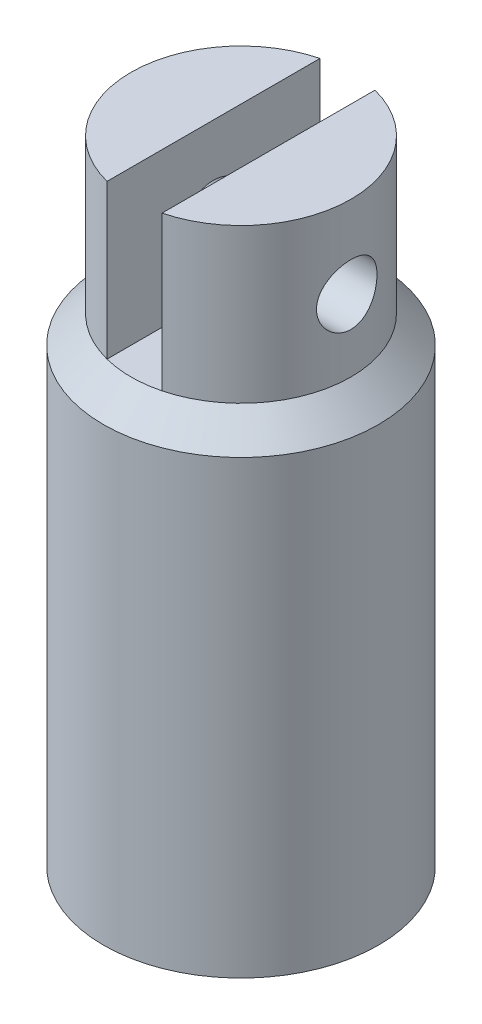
ISO-10303-21;
HEADER;
FILE_DESCRIPTION(('STEP AP214'),'2;1');
FILE_NAME('part.step','',(''),(''),'','','');
FILE_SCHEMA(('AUTOMOTIVE_DESIGN { 1 0 10303 214 1 1 1 1 }'));
ENDSEC;
DATA;
#1=APPLICATION_CONTEXT('core data for automotive mechanical design processes');
#2=APPLICATION_PROTOCOL_DEFINITION('international standard','automotive_design',2000,#1);
#3=PRODUCT_CONTEXT('',#1,'mechanical');
#4=PRODUCT('Part','Part','',(#3));
#5=PRODUCT_RELATED_PRODUCT_CATEGORY('part','',(#4));
#6=PRODUCT_DEFINITION_FORMATION('','',#4);
#7=PRODUCT_DEFINITION_CONTEXT('part definition',#1,'design');
#8=PRODUCT_DEFINITION('design','',#6,#7);
#9=PRODUCT_DEFINITION_SHAPE('','',#8);
#10=(LENGTH_UNIT() NAMED_UNIT(*) SI_UNIT(.MILLI.,.METRE.));
#11=(NAMED_UNIT(*) PLANE_ANGLE_UNIT() SI_UNIT($,.RADIAN.));
#12=(NAMED_UNIT(*) SI_UNIT($,.STERADIAN.) SOLID_ANGLE_UNIT());
#13=UNCERTAINTY_MEASURE_WITH_UNIT(LENGTH_MEASURE(1.E-05),#10,'distance_accuracy_value','');
#14=(GEOMETRIC_REPRESENTATION_CONTEXT(3) GLOBAL_UNCERTAINTY_ASSIGNED_CONTEXT((#13)) GLOBAL_UNIT_ASSIGNED_CONTEXT((#10,
#11,#12)) REPRESENTATION_CONTEXT('',''));
#15=CARTESIAN_POINT('',(0.,0.,0.));
#16=DIRECTION('',(0.,0.,1.));
#17=DIRECTION('',(1.,0.,0.));
#18=AXIS2_PLACEMENT_3D('',#15,#16,#17);
#19=CARTESIAN_POINT('',(0.,2.25,0.));
#20=DIRECTION('',(0.,1.,0.));
#21=DIRECTION('',(0.,0.,1.));
#22=AXIS2_PLACEMENT_3D('',#19,#20,#21);
#23=CYLINDRICAL_SURFACE('',#22,2.);
#24=CARTESIAN_POINT('',(-1.92288845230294,4.25,-0.55));
#25=CARTESIAN_POINT('',(-1.92288893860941,4.21973985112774,-0.549999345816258));
#26=CARTESIAN_POINT('',(-1.92361056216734,4.18947292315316,-0.547494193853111));
#27=CARTESIAN_POINT('',(-1.92640977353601,4.12981576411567,-0.537560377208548));
#28=CARTESIAN_POINT('',(-1.92848798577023,4.10042594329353,-0.530129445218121));
#29=CARTESIAN_POINT('',(-1.93374759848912,4.04339473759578,-0.51060889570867));
#30=CARTESIAN_POINT('',(-1.93692737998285,4.01575085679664,-0.498526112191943));
#31=CARTESIAN_POINT('',(-1.94402975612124,3.96287759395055,-0.470066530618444));
#32=CARTESIAN_POINT('',(-1.9479524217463,3.937648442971,-0.453689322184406));
#33=CARTESIAN_POINT('',(-1.95621550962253,3.88964984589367,-0.416639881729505));
#34=CARTESIAN_POINT('',(-1.96056370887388,3.86695412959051,-0.395873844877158));
#35=CARTESIAN_POINT('',(-1.96912097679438,3.82531959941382,-0.35083779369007));
#36=CARTESIAN_POINT('',(-1.97333003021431,3.80638119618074,-0.326567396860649));
#37=CARTESIAN_POINT('',(-1.98122191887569,3.77248839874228,-0.274697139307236));
#38=CARTESIAN_POINT('',(-1.98489451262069,3.7576077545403,-0.247047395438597));
#39=CARTESIAN_POINT('',(-1.99121017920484,3.73273462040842,-0.189520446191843));
#40=CARTESIAN_POINT('',(-1.99385343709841,3.72274125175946,-0.159643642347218));
#41=CARTESIAN_POINT('',(-1.99775760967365,3.70816625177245,-0.0992807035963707));
#42=CARTESIAN_POINT('',(-1.999050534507,3.7034590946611,-0.0688269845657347));
#43=CARTESIAN_POINT('',(-2.00022047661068,3.69919473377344,-0.00753648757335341));
#44=CARTESIAN_POINT('',(-2.00009774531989,3.69963661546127,0.0233002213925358));
#45=CARTESIAN_POINT('',(-1.99847346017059,3.70557038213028,0.0836060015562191));
#46=CARTESIAN_POINT('',(-1.99700895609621,3.71092657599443,0.113089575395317));
#47=CARTESIAN_POINT('',(-1.99290970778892,3.7263171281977,0.170722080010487));
#48=CARTESIAN_POINT('',(-1.99027489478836,3.73635176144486,0.198870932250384));
#49=CARTESIAN_POINT('',(-1.98407702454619,3.7609153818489,0.253375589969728));
#50=CARTESIAN_POINT('',(-1.98050461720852,3.77548993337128,0.279709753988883));
#51=CARTESIAN_POINT('',(-1.97281506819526,3.80868446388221,0.329604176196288));
#52=CARTESIAN_POINT('',(-1.96869781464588,3.82730527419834,0.353163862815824));
#53=CARTESIAN_POINT('',(-1.9602051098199,3.86878020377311,0.397650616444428));
#54=CARTESIAN_POINT('',(-1.9558256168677,3.89175251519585,0.418466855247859));
#55=CARTESIAN_POINT('',(-1.94742220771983,3.94090680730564,0.455979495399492));
#56=CARTESIAN_POINT('',(-1.94339831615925,3.96708901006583,0.472675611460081));
#57=CARTESIAN_POINT('',(-1.93614468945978,4.02217235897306,0.501565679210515));
#58=CARTESIAN_POINT('',(-1.93292064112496,4.05109106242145,0.51372768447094));
#59=CARTESIAN_POINT('',(-1.92770145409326,4.11067387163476,0.532980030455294));
#60=CARTESIAN_POINT('',(-1.9257059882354,4.14133751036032,0.540071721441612));
#61=CARTESIAN_POINT('',(-1.92324011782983,4.20249880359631,0.548787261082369));
#62=CARTESIAN_POINT('',(-1.92272340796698,4.2329709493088,0.550577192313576));
#63=CARTESIAN_POINT('',(-1.92314653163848,4.2937795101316,0.549097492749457));
#64=CARTESIAN_POINT('',(-1.92408619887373,4.32411594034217,0.54582843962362));
#65=CARTESIAN_POINT('',(-1.92727129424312,4.38313962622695,0.534470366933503));
#66=CARTESIAN_POINT('',(-1.92948919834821,4.4118480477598,0.526482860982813));
#67=CARTESIAN_POINT('',(-1.93495358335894,4.46751722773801,0.506029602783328));
#68=CARTESIAN_POINT('',(-1.93820020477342,4.49447774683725,0.493563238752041));
#69=CARTESIAN_POINT('',(-1.94544998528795,4.5465760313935,0.464174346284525));
#70=CARTESIAN_POINT('',(-1.94946893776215,4.57165705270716,0.447155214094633));
#71=CARTESIAN_POINT('',(-1.9577741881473,4.61866812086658,0.409262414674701));
#72=CARTESIAN_POINT('',(-1.96206053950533,4.64059753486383,0.388387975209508));
#73=CARTESIAN_POINT('',(-1.97057833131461,4.68138111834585,0.34260583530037));
#74=CARTESIAN_POINT('',(-1.97480395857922,4.70011899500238,0.317593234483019));
#75=CARTESIAN_POINT('',(-1.98258856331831,4.7331310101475,0.264681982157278));
#76=CARTESIAN_POINT('',(-1.98614757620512,4.74740538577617,0.236783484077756));
#77=CARTESIAN_POINT('',(-1.99217502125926,4.77095147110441,0.179088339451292));
#78=CARTESIAN_POINT('',(-1.99465164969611,4.78026090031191,0.149307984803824));
#79=CARTESIAN_POINT('',(-1.99827141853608,4.79371983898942,0.0885267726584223));
#80=CARTESIAN_POINT('',(-1.99941487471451,4.79787057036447,0.0575262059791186));
#81=CARTESIAN_POINT('',(-2.00022350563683,4.80081373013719,-0.00373195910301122));
#82=CARTESIAN_POINT('',(-1.99993560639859,4.79977624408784,-0.0339808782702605));
#83=CARTESIAN_POINT('',(-1.99802107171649,4.79277013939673,-0.0938565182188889));
#84=CARTESIAN_POINT('',(-1.99639449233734,4.78680172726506,-0.123483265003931));
#85=CARTESIAN_POINT('',(-1.99199570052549,4.77020174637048,-0.181055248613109));
#86=CARTESIAN_POINT('',(-1.98923245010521,4.75960661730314,-0.209011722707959));
#87=CARTESIAN_POINT('',(-1.98284833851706,4.73408638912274,-0.262765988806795));
#88=CARTESIAN_POINT('',(-1.97922735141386,4.71916065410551,-0.288563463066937));
#89=CARTESIAN_POINT('',(-1.97138708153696,4.68491598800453,-0.338051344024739));
#90=CARTESIAN_POINT('',(-1.96715388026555,4.66548570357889,-0.361662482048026));
#91=CARTESIAN_POINT('',(-1.95861957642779,4.62299209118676,-0.40534649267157));
#92=CARTESIAN_POINT('',(-1.95431845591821,4.59992778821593,-0.425418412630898));
#93=CARTESIAN_POINT('',(-1.94601675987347,4.55016073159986,-0.461929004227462));
#94=CARTESIAN_POINT('',(-1.94202577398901,4.5233844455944,-0.478269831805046));
#95=CARTESIAN_POINT('',(-1.93493544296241,4.46735813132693,-0.506195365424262));
#96=CARTESIAN_POINT('',(-1.93183555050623,4.43810963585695,-0.517782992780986));
#97=CARTESIAN_POINT('',(-1.92727981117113,4.38250122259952,-0.534467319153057));
#98=CARTESIAN_POINT('',(-1.92564688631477,4.35636791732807,-0.540277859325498));
#99=CARTESIAN_POINT('',(-1.92345106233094,4.30349145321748,-0.548044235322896));
#100=CARTESIAN_POINT('',(-1.92288802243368,4.27674837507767,-0.550000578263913));
#101=CARTESIAN_POINT('',(-1.92288845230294,4.25,-0.55));
#102=B_SPLINE_CURVE_WITH_KNOTS('',3,(#24,#25,#26,#27,#28,#29,#30,#31,#32,#33,#34,#35,#36,#37,
#38,#39,#40,#41,#42,#43,#44,#45,#46,#47,#48,#49,#50,#51,#52,#53,#54,#55,#56,#57,#58,#59,#60,#61,
#62,#63,#64,#65,#66,#67,#68,#69,#70,#71,#72,#73,#74,#75,#76,#77,#78,#79,#80,#81,#82,#83,#84,#85,
#86,#87,#88,#89,#90,#91,#92,#93,#94,#95,#96,#97,#98,#99,#100,#101),.UNSPECIFIED.,.T.,.F.,(4,2,2,
2,2,2,2,2,2,2,2,2,2,2,2,2,2,2,2,2,2,2,2,2,2,2,2,2,2,2,2,2,2,2,2,2,2,2,4),(0.,0.0906820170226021,
0.181405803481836,0.271996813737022,0.362596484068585,0.455374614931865,0.54816288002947,
0.642539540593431,0.73689922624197,0.828967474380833,0.921019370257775,1.01060366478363,
1.10019322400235,1.19071260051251,1.28125059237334,1.37473939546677,1.46823467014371,
1.56237677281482,1.65649379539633,1.74762958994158,1.8387549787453,1.92798782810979,
2.01723287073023,2.10854680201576,2.19987904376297,2.29404023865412,2.38819643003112,
2.48162672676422,2.57503488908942,2.6654013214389,2.7557639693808,2.84542741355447,
2.9351040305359,3.02729274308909,3.11950623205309,3.21391446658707,3.3082645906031,
3.3884332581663,3.46859137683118),.UNSPECIFIED.);
#103=CARTESIAN_POINT('',(-1.92288845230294,4.25,-0.55));
#104=VERTEX_POINT('',#103);
#105=EDGE_CURVE('E111',#104,#104,#102,.T.);
#106=ORIENTED_EDGE('',*,*,#105,.F.);
#107=EDGE_LOOP('',(#106));
#108=FACE_BOUND('',#107,.T.);
#109=DIRECTION('',(0.,1.,0.));
#110=VECTOR('',#109,1.);
#111=CARTESIAN_POINT('',(-0.5,2.25,1.93649167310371));
#112=LINE('',#111,#110);
#113=CARTESIAN_POINT('',(-0.5,5.75,1.93649167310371));
#114=VERTEX_POINT('',#113);
#115=CARTESIAN_POINT('',(-0.499999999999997,2.95000000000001,1.93649167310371));
#116=VERTEX_POINT('',#115);
#117=EDGE_CURVE('E86',#114,#116,#112,.F.);
#118=ORIENTED_EDGE('',*,*,#117,.F.);
#119=CARTESIAN_POINT('',(0.,5.75,0.));
#120=DIRECTION('',(0.,1.,0.));
#121=DIRECTION('',(0.,0.,1.));
#122=AXIS2_PLACEMENT_3D('',#119,#120,#121);
#123=CIRCLE('',#122,2.);
#124=CARTESIAN_POINT('',(-0.5,5.75,-1.93649167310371));
#125=VERTEX_POINT('',#124);
#126=EDGE_CURVE('E94',#125,#114,#123,.T.);
#127=ORIENTED_EDGE('',*,*,#126,.F.);
#128=DIRECTION('',(0.,1.,0.));
#129=VECTOR('',#128,1.);
#130=CARTESIAN_POINT('',(-0.5,2.25,-1.93649167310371));
#131=LINE('',#130,#129);
#132=CARTESIAN_POINT('',(-0.5,2.95,-1.93649167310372));
#133=VERTEX_POINT('',#132);
#134=EDGE_CURVE('E85',#133,#125,#131,.T.);
#135=ORIENTED_EDGE('',*,*,#134,.F.);
#136=CARTESIAN_POINT('',(0.,2.95000000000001,0.));
#137=DIRECTION('',(0.,1.,0.));
#138=DIRECTION('',(0.,0.,1.));
#139=AXIS2_PLACEMENT_3D('',#136,#137,#138);
#140=CIRCLE('',#139,2.);
#141=EDGE_CURVE('E81',#133,#116,#140,.T.);
#142=ORIENTED_EDGE('',*,*,#141,.T.);
#143=EDGE_LOOP('',(#118,#127,#135,#142));
#144=FACE_BOUND('',#143,.T.);
#145=ADVANCED_FACE('F32',(#108,#144),#23,.T.);
#146=CARTESIAN_POINT('',(0.,5.75,0.));
#147=DIRECTION('',(0.,1.,0.));
#148=DIRECTION('',(0.,0.,1.));
#149=AXIS2_PLACEMENT_3D('',#146,#147,#148);
#150=PLANE('',#149);
#151=DIRECTION('',(0.,0.,1.));
#152=VECTOR('',#151,1.);
#153=CARTESIAN_POINT('',(-0.5,5.75,-2.5));
#154=LINE('',#153,#152);
#155=EDGE_CURVE('E55',#125,#114,#154,.T.);
#156=ORIENTED_EDGE('',*,*,#155,.F.);
#157=ORIENTED_EDGE('',*,*,#126,.T.);
#158=EDGE_LOOP('',(#156,#157));
#159=FACE_BOUND('',#158,.T.);
#160=ADVANCED_FACE('F145',(#159),#150,.T.);
#161=CARTESIAN_POINT('',(0.,5.75,0.));
#162=DIRECTION('',(0.,-1.,0.));
#163=DIRECTION('',(0.,0.,-1.));
#164=AXIS2_PLACEMENT_3D('',#161,#162,#163);
#165=CYLINDRICAL_SURFACE('',#164,2.5);
#166=CARTESIAN_POINT('',(0.,2.45000000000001,0.));
#167=DIRECTION('',(0.,-1.,0.));
#168=DIRECTION('',(0.,0.,-1.));
#169=AXIS2_PLACEMENT_3D('',#166,#167,#168);
#170=CIRCLE('',#169,2.5);
#171=CARTESIAN_POINT('',(0.,2.45000000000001,-2.5));
#172=VERTEX_POINT('',#171);
#173=EDGE_CURVE('E11',#172,#172,#170,.T.);
#174=ORIENTED_EDGE('',*,*,#173,.T.);
#175=EDGE_LOOP('',(#174));
#176=FACE_BOUND('',#175,.T.);
#177=CARTESIAN_POINT('',(0.,-5.75,0.));
#178=DIRECTION('',(0.,1.,0.));
#179=DIRECTION('',(0.,0.,1.));
#180=AXIS2_PLACEMENT_3D('',#177,#178,#179);
#181=CIRCLE('',#180,2.5);
#182=CARTESIAN_POINT('',(0.,-5.75,2.5));
#183=VERTEX_POINT('',#182);
#184=EDGE_CURVE('E98',#183,#183,#181,.T.);
#185=ORIENTED_EDGE('',*,*,#184,.T.);
#186=EDGE_LOOP('',(#185));
#187=FACE_BOUND('',#186,.T.);
#188=ADVANCED_FACE('F150',(#176,#187),#165,.T.);
#189=CARTESIAN_POINT('',(0.,-5.75,0.));
#190=DIRECTION('',(0.,1.,0.));
#191=DIRECTION('',(0.,0.,1.));
#192=AXIS2_PLACEMENT_3D('',#189,#190,#191);
#193=PLANE('',#192);
#194=ORIENTED_EDGE('',*,*,#184,.F.);
#195=EDGE_LOOP('',(#194));
#196=FACE_BOUND('',#195,.T.);
#197=ADVANCED_FACE('F155',(#196),#193,.F.);
#198=CARTESIAN_POINT('',(1.92288845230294,4.25,-0.55));
#199=CARTESIAN_POINT('',(1.92288893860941,4.28026014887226,-0.549999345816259));
#200=CARTESIAN_POINT('',(1.92361056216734,4.31052707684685,-0.547494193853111));
#201=CARTESIAN_POINT('',(1.92640977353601,4.37018423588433,-0.537560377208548));
#202=CARTESIAN_POINT('',(1.92848798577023,4.39957405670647,-0.530129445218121));
#203=CARTESIAN_POINT('',(1.93374759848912,4.45660526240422,-0.51060889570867));
#204=CARTESIAN_POINT('',(1.93692737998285,4.48424914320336,-0.498526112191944));
#205=CARTESIAN_POINT('',(1.94402975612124,4.53712240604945,-0.470066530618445));
#206=CARTESIAN_POINT('',(1.9479524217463,4.562351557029,-0.453689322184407));
#207=CARTESIAN_POINT('',(1.95621550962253,4.61035015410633,-0.416639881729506));
#208=CARTESIAN_POINT('',(1.96056370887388,4.63304587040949,-0.395873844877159));
#209=CARTESIAN_POINT('',(1.96912097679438,4.67468040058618,-0.350837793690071));
#210=CARTESIAN_POINT('',(1.97333003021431,4.69361880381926,-0.32656739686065));
#211=CARTESIAN_POINT('',(1.98122191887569,4.72751160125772,-0.274697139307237));
#212=CARTESIAN_POINT('',(1.98489451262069,4.7423922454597,-0.247047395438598));
#213=CARTESIAN_POINT('',(1.99121017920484,4.76726537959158,-0.189520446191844));
#214=CARTESIAN_POINT('',(1.99385343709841,4.77725874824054,-0.159643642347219));
#215=CARTESIAN_POINT('',(1.99775760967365,4.79183374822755,-0.0992807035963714));
#216=CARTESIAN_POINT('',(1.999050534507,4.7965409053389,-0.0688269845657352));
#217=CARTESIAN_POINT('',(2.00022047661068,4.80080526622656,-0.00753648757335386));
#218=CARTESIAN_POINT('',(2.00009774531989,4.80036338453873,0.0233002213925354));
#219=CARTESIAN_POINT('',(1.99847346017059,4.79442961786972,0.0836060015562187));
#220=CARTESIAN_POINT('',(1.99700895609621,4.78907342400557,0.113089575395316));
#221=CARTESIAN_POINT('',(1.99290970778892,4.7736828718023,0.170722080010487));
#222=CARTESIAN_POINT('',(1.99027489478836,4.76364823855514,0.198870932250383));
#223=CARTESIAN_POINT('',(1.98407702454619,4.7390846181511,0.253375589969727));
#224=CARTESIAN_POINT('',(1.98050461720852,4.72451006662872,0.279709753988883));
#225=CARTESIAN_POINT('',(1.97281506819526,4.69131553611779,0.329604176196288));
#226=CARTESIAN_POINT('',(1.96869781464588,4.67269472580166,0.353163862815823));
#227=CARTESIAN_POINT('',(1.9602051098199,4.63121979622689,0.397650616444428));
#228=CARTESIAN_POINT('',(1.9558256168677,4.60824748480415,0.418466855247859));
#229=CARTESIAN_POINT('',(1.94742220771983,4.55909319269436,0.455979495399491));
#230=CARTESIAN_POINT('',(1.94339831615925,4.53291098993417,0.47267561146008));
#231=CARTESIAN_POINT('',(1.93614468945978,4.47782764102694,0.501565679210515));
#232=CARTESIAN_POINT('',(1.93292064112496,4.44890893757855,0.51372768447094));
#233=CARTESIAN_POINT('',(1.92770145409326,4.38932612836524,0.532980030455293));
#234=CARTESIAN_POINT('',(1.9257059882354,4.35866248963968,0.540071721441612));
#235=CARTESIAN_POINT('',(1.92324011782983,4.29750119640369,0.548787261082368));
#236=CARTESIAN_POINT('',(1.92272340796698,4.2670290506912,0.550577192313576));
#237=CARTESIAN_POINT('',(1.92314653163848,4.2062204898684,0.549097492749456));
#238=CARTESIAN_POINT('',(1.92408619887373,4.17588405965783,0.54582843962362));
#239=CARTESIAN_POINT('',(1.92727129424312,4.11686037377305,0.534470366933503));
#240=CARTESIAN_POINT('',(1.92948919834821,4.0881519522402,0.526482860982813));
#241=CARTESIAN_POINT('',(1.93495358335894,4.03248277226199,0.506029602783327));
#242=CARTESIAN_POINT('',(1.93820020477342,4.00552225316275,0.49356323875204));
#243=CARTESIAN_POINT('',(1.94544998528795,3.9534239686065,0.464174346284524));
#244=CARTESIAN_POINT('',(1.94946893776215,3.92834294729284,0.447155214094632));
#245=CARTESIAN_POINT('',(1.9577741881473,3.88133187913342,0.409262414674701));
#246=CARTESIAN_POINT('',(1.96206053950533,3.85940246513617,0.388387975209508));
#247=CARTESIAN_POINT('',(1.97057833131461,3.81861888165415,0.342605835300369));
#248=CARTESIAN_POINT('',(1.97480395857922,3.79988100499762,0.317593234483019));
#249=CARTESIAN_POINT('',(1.98258856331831,3.76686898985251,0.264681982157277));
#250=CARTESIAN_POINT('',(1.98614757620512,3.75259461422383,0.236783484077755));
#251=CARTESIAN_POINT('',(1.99217502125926,3.72904852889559,0.179088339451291));
#252=CARTESIAN_POINT('',(1.99465164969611,3.71973909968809,0.149307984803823));
#253=CARTESIAN_POINT('',(1.99827141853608,3.70628016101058,0.0885267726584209));
#254=CARTESIAN_POINT('',(1.99941487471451,3.70212942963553,0.0575262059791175));
#255=CARTESIAN_POINT('',(2.00022350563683,3.69918626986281,-0.00373195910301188));
#256=CARTESIAN_POINT('',(1.99993560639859,3.70022375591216,-0.0339808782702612));
#257=CARTESIAN_POINT('',(1.99802107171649,3.70722986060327,-0.0938565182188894));
#258=CARTESIAN_POINT('',(1.99639449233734,3.71319827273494,-0.123483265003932));
#259=CARTESIAN_POINT('',(1.99199570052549,3.72979825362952,-0.18105524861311));
#260=CARTESIAN_POINT('',(1.98923245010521,3.74039338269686,-0.209011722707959));
#261=CARTESIAN_POINT('',(1.98284833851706,3.76591361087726,-0.262765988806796));
#262=CARTESIAN_POINT('',(1.97922735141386,3.78083934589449,-0.288563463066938));
#263=CARTESIAN_POINT('',(1.97138708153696,3.81508401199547,-0.338051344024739));
#264=CARTESIAN_POINT('',(1.96715388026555,3.83451429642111,-0.361662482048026));
#265=CARTESIAN_POINT('',(1.95861957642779,3.87700790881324,-0.40534649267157));
#266=CARTESIAN_POINT('',(1.95431845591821,3.90007221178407,-0.425418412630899));
#267=CARTESIAN_POINT('',(1.94601675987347,3.94983926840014,-0.461929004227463));
#268=CARTESIAN_POINT('',(1.94202577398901,3.9766155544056,-0.478269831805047));
#269=CARTESIAN_POINT('',(1.93493544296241,4.03264186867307,-0.506195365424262));
#270=CARTESIAN_POINT('',(1.93183555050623,4.06189036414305,-0.517782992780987));
#271=CARTESIAN_POINT('',(1.92727981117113,4.11749877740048,-0.534467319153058));
#272=CARTESIAN_POINT('',(1.92564688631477,4.14363208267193,-0.540277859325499));
#273=CARTESIAN_POINT('',(1.92345106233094,4.19650854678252,-0.548044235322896));
#274=CARTESIAN_POINT('',(1.92288802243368,4.22325162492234,-0.550000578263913));
#275=CARTESIAN_POINT('',(1.92288845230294,4.25,-0.55));
#276=B_SPLINE_CURVE_WITH_KNOTS('',3,(#198,#199,#200,#201,#202,#203,#204,#205,#206,#207,#208,
#209,#210,#211,#212,#213,#214,#215,#216,#217,#218,#219,#220,#221,#222,#223,#224,#225,#226,#227,
#228,#229,#230,#231,#232,#233,#234,#235,#236,#237,#238,#239,#240,#241,#242,#243,#244,#245,#246,
#247,#248,#249,#250,#251,#252,#253,#254,#255,#256,#257,#258,#259,#260,#261,#262,#263,#264,#265,
#266,#267,#268,#269,#270,#271,#272,#273,#274,#275),.UNSPECIFIED.,.T.,.F.,(4,2,2,2,2,2,2,2,2,2,2,
2,2,2,2,2,2,2,2,2,2,2,2,2,2,2,2,2,2,2,2,2,2,2,2,2,2,2,4),(0.,0.0906820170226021,
0.181405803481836,0.27199681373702,0.362596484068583,0.455374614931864,0.54816288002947,
0.642539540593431,0.73689922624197,0.828967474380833,0.921019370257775,1.01060366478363,
1.10019322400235,1.19071260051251,1.28125059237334,1.37473939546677,1.46823467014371,
1.56237677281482,1.65649379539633,1.74762958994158,1.8387549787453,1.92798782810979,
2.01723287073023,2.10854680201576,2.19987904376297,2.29404023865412,2.38819643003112,
2.48162672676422,2.57503488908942,2.6654013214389,2.7557639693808,2.84542741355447,
2.9351040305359,3.02729274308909,3.11950623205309,3.21391446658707,3.3082645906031,
3.3884332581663,3.46859137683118),.UNSPECIFIED.);
#277=CARTESIAN_POINT('',(1.92288845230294,4.25,-0.55));
#278=VERTEX_POINT('',#277);
#279=EDGE_CURVE('E119',#278,#278,#276,.T.);
#280=ORIENTED_EDGE('',*,*,#279,.F.);
#281=EDGE_LOOP('',(#280));
#282=FACE_BOUND('',#281,.T.);
#283=DIRECTION('',(0.,1.,0.));
#284=VECTOR('',#283,1.);
#285=CARTESIAN_POINT('',(0.5,2.25,-1.93649167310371));
#286=LINE('',#285,#284);
#287=CARTESIAN_POINT('',(0.5,5.75,-1.93649167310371));
#288=VERTEX_POINT('',#287);
#289=CARTESIAN_POINT('',(0.5,2.95,-1.93649167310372));
#290=VERTEX_POINT('',#289);
#291=EDGE_CURVE('E95',#288,#290,#286,.F.);
#292=ORIENTED_EDGE('',*,*,#291,.F.);
#293=CARTESIAN_POINT('',(0.5,5.75,1.93649167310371));
#294=VERTEX_POINT('',#293);
#295=EDGE_CURVE('E102',#294,#288,#123,.T.);
#296=ORIENTED_EDGE('',*,*,#295,.F.);
#297=DIRECTION('',(0.,1.,0.));
#298=VECTOR('',#297,1.);
#299=CARTESIAN_POINT('',(0.5,2.25,1.93649167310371));
#300=LINE('',#299,#298);
#301=CARTESIAN_POINT('',(0.5,2.95,1.93649167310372));
#302=VERTEX_POINT('',#301);
#303=EDGE_CURVE('E107',#302,#294,#300,.T.);
#304=ORIENTED_EDGE('',*,*,#303,.F.);
#305=EDGE_CURVE('E41',#302,#290,#140,.T.);
#306=ORIENTED_EDGE('',*,*,#305,.T.);
#307=EDGE_LOOP('',(#292,#296,#304,#306));
#308=FACE_BOUND('',#307,.T.);
#309=ADVANCED_FACE('F123',(#282,#308),#23,.T.);
#310=DIRECTION('',(0.,0.,-1.));
#311=VECTOR('',#310,1.);
#312=CARTESIAN_POINT('',(0.5,5.75,-2.5));
#313=LINE('',#312,#311);
#314=EDGE_CURVE('E88',#294,#288,#313,.T.);
#315=ORIENTED_EDGE('',*,*,#314,.F.);
#316=ORIENTED_EDGE('',*,*,#295,.T.);
#317=EDGE_LOOP('',(#315,#316));
#318=FACE_BOUND('',#317,.T.);
#319=ADVANCED_FACE('F152',(#318),#150,.T.);
#320=CARTESIAN_POINT('',(0.,2.95000000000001,0.));
#321=DIRECTION('',(0.,-1.,0.));
#322=DIRECTION('',(0.,0.,-1.));
#323=AXIS2_PLACEMENT_3D('',#320,#321,#322);
#324=CONICAL_SURFACE('',#323,2.,0.785398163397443);
#325=ORIENTED_EDGE('',*,*,#173,.F.);
#326=EDGE_LOOP('',(#325));
#327=FACE_BOUND('',#326,.T.);
#328=ORIENTED_EDGE('',*,*,#305,.F.);
#329=EDGE_CURVE('E97',#116,#302,#140,.T.);
#330=ORIENTED_EDGE('',*,*,#329,.F.);
#331=ORIENTED_EDGE('',*,*,#141,.F.);
#332=EDGE_CURVE('E73',#290,#133,#140,.T.);
#333=ORIENTED_EDGE('',*,*,#332,.F.);
#334=EDGE_LOOP('',(#328,#330,#331,#333));
#335=FACE_BOUND('',#334,.T.);
#336=ADVANCED_FACE('F34',(#327,#335),#324,.T.);
#337=CARTESIAN_POINT('',(0.,2.95,0.));
#338=DIRECTION('',(0.,1.,0.));
#339=DIRECTION('',(0.,0.,1.));
#340=AXIS2_PLACEMENT_3D('',#337,#338,#339);
#341=PLANE('',#340);
#342=ORIENTED_EDGE('',*,*,#332,.T.);
#343=DIRECTION('',(0.,0.,1.));
#344=VECTOR('',#343,1.);
#345=CARTESIAN_POINT('',(-0.5,2.95,-2.5));
#346=LINE('',#345,#344);
#347=EDGE_CURVE('E48',#133,#116,#346,.T.);
#348=ORIENTED_EDGE('',*,*,#347,.T.);
#349=ORIENTED_EDGE('',*,*,#329,.T.);
#350=DIRECTION('',(0.,0.,-1.));
#351=VECTOR('',#350,1.);
#352=CARTESIAN_POINT('',(0.5,2.95,-2.5));
#353=LINE('',#352,#351);
#354=EDGE_CURVE('E76',#302,#290,#353,.T.);
#355=ORIENTED_EDGE('',*,*,#354,.T.);
#356=EDGE_LOOP('',(#342,#348,#349,#355));
#357=FACE_BOUND('',#356,.T.);
#358=ADVANCED_FACE('F74',(#357),#341,.T.);
#359=CARTESIAN_POINT('',(-0.5,2.95,-2.5));
#360=DIRECTION('',(-1.,0.,0.));
#361=DIRECTION('',(0.,0.,1.));
#362=AXIS2_PLACEMENT_3D('',#359,#360,#361);
#363=PLANE('',#362);
#364=CARTESIAN_POINT('',(-0.5,4.25,0.));
#365=DIRECTION('',(-1.,0.,0.));
#366=DIRECTION('',(0.,0.,1.));
#367=AXIS2_PLACEMENT_3D('',#364,#365,#366);
#368=CIRCLE('',#367,0.55);
#369=CARTESIAN_POINT('',(-0.5,4.25,0.55));
#370=VERTEX_POINT('',#369);
#371=EDGE_CURVE('E173',#370,#370,#368,.T.);
#372=ORIENTED_EDGE('',*,*,#371,.T.);
#373=EDGE_LOOP('',(#372));
#374=FACE_BOUND('',#373,.T.);
#375=ORIENTED_EDGE('',*,*,#117,.T.);
#376=ORIENTED_EDGE('',*,*,#347,.F.);
#377=ORIENTED_EDGE('',*,*,#134,.T.);
#378=ORIENTED_EDGE('',*,*,#155,.T.);
#379=EDGE_LOOP('',(#375,#376,#377,#378));
#380=FACE_BOUND('',#379,.T.);
#381=ADVANCED_FACE('F84',(#374,#380),#363,.F.);
#382=CARTESIAN_POINT('',(0.5,2.95,-2.5));
#383=DIRECTION('',(1.,0.,0.));
#384=DIRECTION('',(0.,0.,-1.));
#385=AXIS2_PLACEMENT_3D('',#382,#383,#384);
#386=PLANE('',#385);
#387=CARTESIAN_POINT('',(0.5,4.25,0.));
#388=DIRECTION('',(1.,0.,0.));
#389=DIRECTION('',(0.,0.,-1.));
#390=AXIS2_PLACEMENT_3D('',#387,#388,#389);
#391=CIRCLE('',#390,0.55);
#392=CARTESIAN_POINT('',(0.5,4.25,-0.55));
#393=VERTEX_POINT('',#392);
#394=EDGE_CURVE('E36',#393,#393,#391,.T.);
#395=ORIENTED_EDGE('',*,*,#394,.T.);
#396=EDGE_LOOP('',(#395));
#397=FACE_BOUND('',#396,.T.);
#398=ORIENTED_EDGE('',*,*,#291,.T.);
#399=ORIENTED_EDGE('',*,*,#354,.F.);
#400=ORIENTED_EDGE('',*,*,#303,.T.);
#401=ORIENTED_EDGE('',*,*,#314,.T.);
#402=EDGE_LOOP('',(#398,#399,#400,#401));
#403=FACE_BOUND('',#402,.T.);
#404=ADVANCED_FACE('F136',(#397,#403),#386,.F.);
#405=CARTESIAN_POINT('',(-2.5,4.25,0.));
#406=DIRECTION('',(1.,0.,0.));
#407=DIRECTION('',(0.,0.,-1.));
#408=AXIS2_PLACEMENT_3D('',#405,#406,#407);
#409=CYLINDRICAL_SURFACE('',#408,0.55);
#410=ORIENTED_EDGE('',*,*,#279,.T.);
#411=EDGE_LOOP('',(#410));
#412=FACE_BOUND('',#411,.T.);
#413=ORIENTED_EDGE('',*,*,#394,.F.);
#414=EDGE_LOOP('',(#413));
#415=FACE_BOUND('',#414,.T.);
#416=ADVANCED_FACE('F131',(#412,#415),#409,.F.);
#417=ORIENTED_EDGE('',*,*,#105,.T.);
#418=EDGE_LOOP('',(#417));
#419=FACE_BOUND('',#418,.T.);
#420=ORIENTED_EDGE('',*,*,#371,.F.);
#421=EDGE_LOOP('',(#420));
#422=FACE_BOUND('',#421,.T.);
#423=ADVANCED_FACE('F127',(#419,#422),#409,.F.);
#424=CLOSED_SHELL('',(#145,#160,#188,#197,#309,#319,#336,#358,#381,#404,#416,#423));
#425=MANIFOLD_SOLID_BREP('B2',#424);
#426=ADVANCED_BREP_SHAPE_REPRESENTATION('',(#18,#425),#14);
#427=SHAPE_DEFINITION_REPRESENTATION(#9,#426);
ENDSEC;
END-ISO-10303-21;
